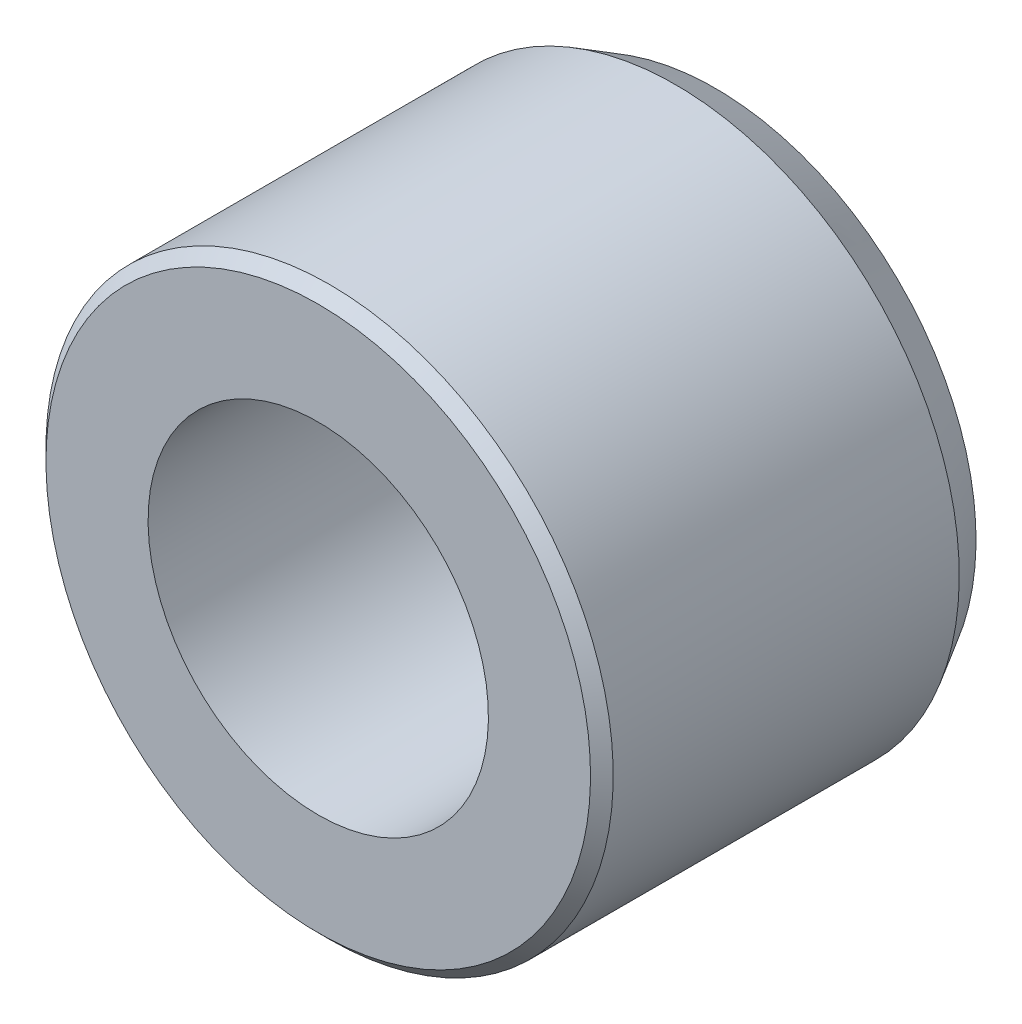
ISO-10303-21;
HEADER;
FILE_DESCRIPTION(('STEP AP214'),'2;1');
FILE_NAME('part.step','',(''),(''),'','','');
FILE_SCHEMA(('AUTOMOTIVE_DESIGN { 1 0 10303 214 1 1 1 1 }'));
ENDSEC;
DATA;
#1=APPLICATION_CONTEXT('core data for automotive mechanical design processes');
#2=APPLICATION_PROTOCOL_DEFINITION('international standard','automotive_design',2000,#1);
#3=PRODUCT_CONTEXT('',#1,'mechanical');
#4=PRODUCT('Part','Part','',(#3));
#5=PRODUCT_RELATED_PRODUCT_CATEGORY('part','',(#4));
#6=PRODUCT_DEFINITION_FORMATION('','',#4);
#7=PRODUCT_DEFINITION_CONTEXT('part definition',#1,'design');
#8=PRODUCT_DEFINITION('design','',#6,#7);
#9=PRODUCT_DEFINITION_SHAPE('','',#8);
#10=(LENGTH_UNIT() NAMED_UNIT(*) SI_UNIT(.MILLI.,.METRE.));
#11=(NAMED_UNIT(*) PLANE_ANGLE_UNIT() SI_UNIT($,.RADIAN.));
#12=(NAMED_UNIT(*) SI_UNIT($,.STERADIAN.) SOLID_ANGLE_UNIT());
#13=UNCERTAINTY_MEASURE_WITH_UNIT(LENGTH_MEASURE(1.E-05),#10,'distance_accuracy_value','');
#14=(GEOMETRIC_REPRESENTATION_CONTEXT(3) GLOBAL_UNCERTAINTY_ASSIGNED_CONTEXT((#13)) GLOBAL_UNIT_ASSIGNED_CONTEXT((#10,
#11,#12)) REPRESENTATION_CONTEXT('',''));
#15=CARTESIAN_POINT('',(0.,0.,0.));
#16=DIRECTION('',(0.,0.,1.));
#17=DIRECTION('',(1.,0.,0.));
#18=AXIS2_PLACEMENT_3D('',#15,#16,#17);
#19=CARTESIAN_POINT('',(0.,0.,-7.));
#20=DIRECTION('',(0.,0.,1.));
#21=DIRECTION('',(0.,-1.,0.));
#22=AXIS2_PLACEMENT_3D('',#19,#20,#21);
#23=CYLINDRICAL_SURFACE('',#22,3.);
#24=CARTESIAN_POINT('',(0.,0.,0.));
#25=DIRECTION('',(0.,0.,1.));
#26=DIRECTION('',(0.,-1.,0.));
#27=AXIS2_PLACEMENT_3D('',#24,#25,#26);
#28=CIRCLE('',#27,3.);
#29=CARTESIAN_POINT('',(0.,-3.,0.));
#30=VERTEX_POINT('',#29);
#31=EDGE_CURVE('E15',#30,#30,#28,.F.);
#32=ORIENTED_EDGE('',*,*,#31,.F.);
#33=EDGE_LOOP('',(#32));
#34=FACE_BOUND('',#33,.T.);
#35=CARTESIAN_POINT('',(0.,0.,-7.));
#36=DIRECTION('',(0.,0.,1.));
#37=DIRECTION('',(0.,-1.,0.));
#38=AXIS2_PLACEMENT_3D('',#35,#36,#37);
#39=CIRCLE('',#38,3.);
#40=CARTESIAN_POINT('',(0.,-3.,-7.));
#41=VERTEX_POINT('',#40);
#42=EDGE_CURVE('E35',#41,#41,#39,.T.);
#43=ORIENTED_EDGE('',*,*,#42,.F.);
#44=EDGE_LOOP('',(#43));
#45=FACE_BOUND('',#44,.T.);
#46=ADVANCED_FACE('F12',(#34,#45),#23,.F.);
#47=CARTESIAN_POINT('',(4.8,0.,0.));
#48=DIRECTION('',(0.,0.,1.));
#49=DIRECTION('',(0.,-1.,0.));
#50=AXIS2_PLACEMENT_3D('',#47,#48,#49);
#51=PLANE('',#50);
#52=CARTESIAN_POINT('',(0.,0.,5.00207514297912E-12));
#53=DIRECTION('',(0.,0.,-1.));
#54=DIRECTION('',(0.,1.,0.));
#55=AXIS2_PLACEMENT_3D('',#52,#53,#54);
#56=CIRCLE('',#55,4.80000000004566);
#57=CARTESIAN_POINT('',(0.,4.80000000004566,5.00207514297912E-12));
#58=VERTEX_POINT('',#57);
#59=EDGE_CURVE('E33',#58,#58,#56,.T.);
#60=ORIENTED_EDGE('',*,*,#59,.F.);
#61=EDGE_LOOP('',(#60));
#62=FACE_BOUND('',#61,.T.);
#63=ORIENTED_EDGE('',*,*,#31,.T.);
#64=EDGE_LOOP('',(#63));
#65=FACE_BOUND('',#64,.T.);
#66=ADVANCED_FACE('F42',(#62,#65),#51,.T.);
#67=CARTESIAN_POINT('',(3.,0.,-7.));
#68=DIRECTION('',(0.,0.,-1.));
#69=DIRECTION('',(0.,1.,0.));
#70=AXIS2_PLACEMENT_3D('',#67,#68,#69);
#71=PLANE('',#70);
#72=ORIENTED_EDGE('',*,*,#42,.T.);
#73=EDGE_LOOP('',(#72));
#74=FACE_BOUND('',#73,.T.);
#75=CARTESIAN_POINT('',(0.,0.,-6.99999999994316));
#76=DIRECTION('',(0.,0.,1.));
#77=DIRECTION('',(0.,-1.,0.));
#78=AXIS2_PLACEMENT_3D('',#75,#76,#77);
#79=CIRCLE('',#78,4.595854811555);
#80=CARTESIAN_POINT('',(0.,-4.595854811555,-6.99999999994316));
#81=VERTEX_POINT('',#80);
#82=EDGE_CURVE('E24',#81,#81,#79,.T.);
#83=ORIENTED_EDGE('',*,*,#82,.F.);
#84=EDGE_LOOP('',(#83));
#85=FACE_BOUND('',#84,.T.);
#86=ADVANCED_FACE('F50',(#74,#85),#71,.T.);
#87=CARTESIAN_POINT('',(0.,0.,-0.200000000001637));
#88=DIRECTION('',(0.,0.,-1.));
#89=DIRECTION('',(0.,1.,0.));
#90=AXIS2_PLACEMENT_3D('',#87,#88,#89);
#91=CONICAL_SURFACE('',#90,5.0000000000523,0.785398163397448);
#92=CARTESIAN_POINT('',(0.,0.,-0.2));
#93=DIRECTION('',(0.,0.,1.));
#94=DIRECTION('',(0.,-1.,0.));
#95=AXIS2_PLACEMENT_3D('',#92,#93,#94);
#96=CIRCLE('',#95,5.);
#97=CARTESIAN_POINT('',(0.,-5.,-0.2));
#98=VERTEX_POINT('',#97);
#99=EDGE_CURVE('E19',#98,#98,#96,.F.);
#100=ORIENTED_EDGE('',*,*,#99,.F.);
#101=EDGE_LOOP('',(#100));
#102=FACE_BOUND('',#101,.T.);
#103=ORIENTED_EDGE('',*,*,#59,.T.);
#104=EDGE_LOOP('',(#103));
#105=FACE_BOUND('',#104,.T.);
#106=ADVANCED_FACE('F59',(#102,#105),#91,.T.);
#107=CARTESIAN_POINT('',(0.,0.,-6.29999999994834));
#108=DIRECTION('',(0.,0.,1.));
#109=DIRECTION('',(0.,-1.,0.));
#110=AXIS2_PLACEMENT_3D('',#107,#108,#109);
#111=CONICAL_SURFACE('',#110,4.99999999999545,0.523598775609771);
#112=ORIENTED_EDGE('',*,*,#82,.T.);
#113=EDGE_LOOP('',(#112));
#114=FACE_BOUND('',#113,.T.);
#115=CARTESIAN_POINT('',(0.,0.,-6.3));
#116=DIRECTION('',(0.,0.,1.));
#117=DIRECTION('',(0.,-1.,0.));
#118=AXIS2_PLACEMENT_3D('',#115,#116,#117);
#119=CIRCLE('',#118,5.);
#120=CARTESIAN_POINT('',(0.,-5.,-6.3));
#121=VERTEX_POINT('',#120);
#122=EDGE_CURVE('E8',#121,#121,#119,.T.);
#123=ORIENTED_EDGE('',*,*,#122,.F.);
#124=EDGE_LOOP('',(#123));
#125=FACE_BOUND('',#124,.T.);
#126=ADVANCED_FACE('F54',(#114,#125),#111,.T.);
#127=CARTESIAN_POINT('',(0.,0.,-7.));
#128=DIRECTION('',(0.,0.,1.));
#129=DIRECTION('',(0.,-1.,0.));
#130=AXIS2_PLACEMENT_3D('',#127,#128,#129);
#131=CYLINDRICAL_SURFACE('',#130,5.);
#132=ORIENTED_EDGE('',*,*,#122,.T.);
#133=EDGE_LOOP('',(#132));
#134=FACE_BOUND('',#133,.T.);
#135=ORIENTED_EDGE('',*,*,#99,.T.);
#136=EDGE_LOOP('',(#135));
#137=FACE_BOUND('',#136,.T.);
#138=ADVANCED_FACE('F52',(#134,#137),#131,.T.);
#139=CLOSED_SHELL('',(#46,#66,#86,#106,#126,#138));
#140=MANIFOLD_SOLID_BREP('B1',#139);
#141=ADVANCED_BREP_SHAPE_REPRESENTATION('',(#18,#140),#14);
#142=SHAPE_DEFINITION_REPRESENTATION(#9,#141);
ENDSEC;
END-ISO-10303-21;
